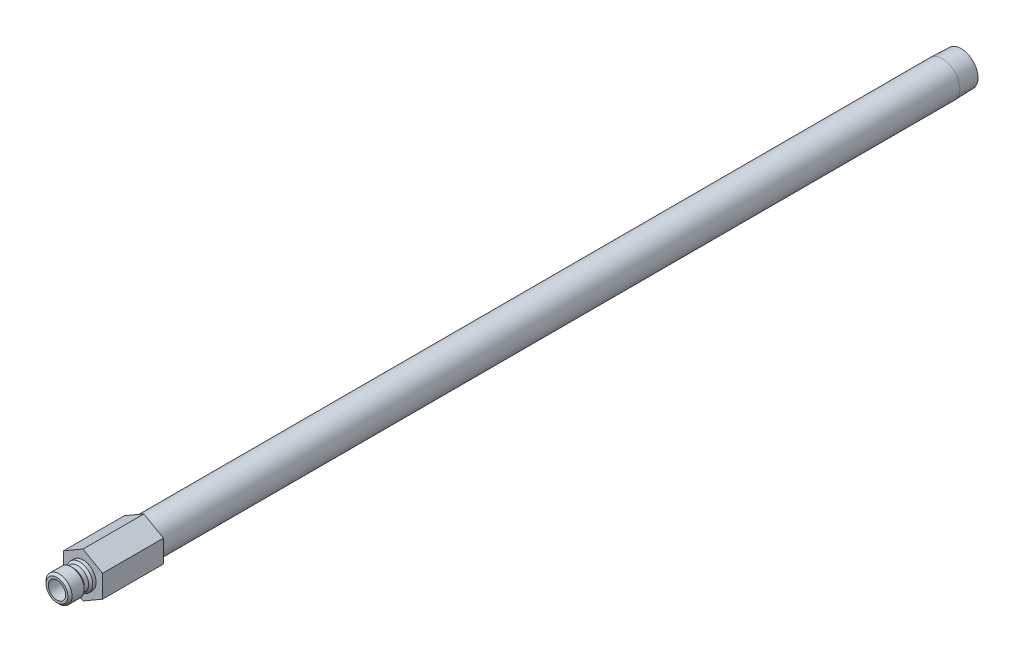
ISO-10303-21;
HEADER;
FILE_DESCRIPTION(('STEP AP214'),'2;1');
FILE_NAME('part.step','',(''),(''),'','','');
FILE_SCHEMA(('AUTOMOTIVE_DESIGN { 1 0 10303 214 1 1 1 1 }'));
ENDSEC;
DATA;
#1=APPLICATION_CONTEXT('core data for automotive mechanical design processes');
#2=APPLICATION_PROTOCOL_DEFINITION('international standard','automotive_design',2000,#1);
#3=PRODUCT_CONTEXT('',#1,'mechanical');
#4=PRODUCT('Part','Part','',(#3));
#5=PRODUCT_RELATED_PRODUCT_CATEGORY('part','',(#4));
#6=PRODUCT_DEFINITION_FORMATION('','',#4);
#7=PRODUCT_DEFINITION_CONTEXT('part definition',#1,'design');
#8=PRODUCT_DEFINITION('design','',#6,#7);
#9=PRODUCT_DEFINITION_SHAPE('','',#8);
#10=(LENGTH_UNIT() NAMED_UNIT(*) SI_UNIT(.MILLI.,.METRE.));
#11=(NAMED_UNIT(*) PLANE_ANGLE_UNIT() SI_UNIT($,.RADIAN.));
#12=(NAMED_UNIT(*) SI_UNIT($,.STERADIAN.) SOLID_ANGLE_UNIT());
#13=UNCERTAINTY_MEASURE_WITH_UNIT(LENGTH_MEASURE(1.E-05),#10,'distance_accuracy_value','');
#14=(GEOMETRIC_REPRESENTATION_CONTEXT(3) GLOBAL_UNCERTAINTY_ASSIGNED_CONTEXT((#13)) GLOBAL_UNIT_ASSIGNED_CONTEXT((#10,
#11,#12)) REPRESENTATION_CONTEXT('',''));
#15=CARTESIAN_POINT('',(0.,0.,0.));
#16=DIRECTION('',(0.,0.,1.));
#17=DIRECTION('',(1.,0.,0.));
#18=AXIS2_PLACEMENT_3D('',#15,#16,#17);
#19=CARTESIAN_POINT('',(0.,0.,0.));
#20=DIRECTION('',(0.,0.,-1.));
#21=DIRECTION('',(0.,1.,0.));
#22=AXIS2_PLACEMENT_3D('',#19,#20,#21);
#23=CYLINDRICAL_SURFACE('',#22,6.34999999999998);
#24=CARTESIAN_POINT('',(0.,0.,-313.817));
#25=DIRECTION('',(0.,0.,-1.));
#26=DIRECTION('',(0.,1.,0.));
#27=AXIS2_PLACEMENT_3D('',#24,#25,#26);
#28=CIRCLE('',#27,6.34999999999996);
#29=CARTESIAN_POINT('',(0.,6.35,-313.817));
#30=VERTEX_POINT('',#29);
#31=EDGE_CURVE('E42',#30,#30,#28,.T.);
#32=ORIENTED_EDGE('',*,*,#31,.F.);
#33=EDGE_LOOP('',(#32));
#34=FACE_BOUND('',#33,.T.);
#35=CARTESIAN_POINT('',(0.,0.,-22.225));
#36=DIRECTION('',(0.,0.,1.));
#37=DIRECTION('',(1.,0.,0.));
#38=AXIS2_PLACEMENT_3D('',#35,#36,#37);
#39=CIRCLE('',#38,6.34999999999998);
#40=CARTESIAN_POINT('',(6.34999999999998,0.,-22.225));
#41=VERTEX_POINT('',#40);
#42=EDGE_CURVE('E138',#41,#41,#39,.F.);
#43=ORIENTED_EDGE('',*,*,#42,.T.);
#44=EDGE_LOOP('',(#43));
#45=FACE_BOUND('',#44,.T.);
#46=ADVANCED_FACE('F33',(#34,#45),#23,.T.);
#47=CARTESIAN_POINT('',(0.,6.1356887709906,-320.675));
#48=DIRECTION('',(0.,0.,-1.));
#49=DIRECTION('',(0.,1.,0.));
#50=AXIS2_PLACEMENT_3D('',#47,#48,#49);
#51=PLANE('',#50);
#52=CARTESIAN_POINT('',(0.,0.,-320.675));
#53=DIRECTION('',(0.,0.,-1.));
#54=DIRECTION('',(0.,1.,0.));
#55=AXIS2_PLACEMENT_3D('',#52,#53,#54);
#56=CIRCLE('',#55,6.13568877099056);
#57=CARTESIAN_POINT('',(0.,6.1356887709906,-320.675));
#58=VERTEX_POINT('',#57);
#59=EDGE_CURVE('E11',#58,#58,#56,.T.);
#60=ORIENTED_EDGE('',*,*,#59,.T.);
#61=EDGE_LOOP('',(#60));
#62=FACE_BOUND('',#61,.T.);
#63=CARTESIAN_POINT('',(0.,0.,-320.675));
#64=DIRECTION('',(0.,0.,-1.));
#65=DIRECTION('',(0.,1.,0.));
#66=AXIS2_PLACEMENT_3D('',#63,#64,#65);
#67=CIRCLE('',#66,4.62279999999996);
#68=CARTESIAN_POINT('',(0.,4.6228,-320.675));
#69=VERTEX_POINT('',#68);
#70=EDGE_CURVE('E146',#69,#69,#67,.T.);
#71=ORIENTED_EDGE('',*,*,#70,.F.);
#72=EDGE_LOOP('',(#71));
#73=FACE_BOUND('',#72,.T.);
#74=ADVANCED_FACE('F35',(#62,#73),#51,.T.);
#75=CARTESIAN_POINT('',(0.,0.,-320.675));
#76=DIRECTION('',(0.,0.,1.));
#77=DIRECTION('',(0.,-1.,0.));
#78=AXIS2_PLACEMENT_3D('',#75,#76,#77);
#79=CONICAL_SURFACE('',#78,6.13568877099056,0.0312396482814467);
#80=ORIENTED_EDGE('',*,*,#31,.T.);
#81=EDGE_LOOP('',(#80));
#82=FACE_BOUND('',#81,.T.);
#83=ORIENTED_EDGE('',*,*,#59,.F.);
#84=EDGE_LOOP('',(#83));
#85=FACE_BOUND('',#84,.T.);
#86=ADVANCED_FACE('F181',(#82,#85),#79,.T.);
#87=CARTESIAN_POINT('',(0.,4.7625,0.));
#88=DIRECTION('',(0.,0.,1.));
#89=DIRECTION('',(0.,-1.,0.));
#90=AXIS2_PLACEMENT_3D('',#87,#88,#89);
#91=PLANE('',#90);
#92=CARTESIAN_POINT('',(0.,0.,0.));
#93=DIRECTION('',(0.,0.,-1.));
#94=DIRECTION('',(0.,1.,0.));
#95=AXIS2_PLACEMENT_3D('',#92,#93,#94);
#96=CIRCLE('',#95,4.7625);
#97=CARTESIAN_POINT('',(0.,4.7625,0.));
#98=VERTEX_POINT('',#97);
#99=EDGE_CURVE('E176',#98,#98,#96,.T.);
#100=ORIENTED_EDGE('',*,*,#99,.T.);
#101=EDGE_LOOP('',(#100));
#102=FACE_BOUND('',#101,.T.);
#103=DIRECTION('',(-0.866025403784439,-0.5,0.));
#104=VECTOR('',#103,1.);
#105=CARTESIAN_POINT('',(0.,8.21223022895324,0.));
#106=LINE('',#105,#104);
#107=CARTESIAN_POINT('',(0.,8.21223022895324,0.));
#108=VERTEX_POINT('',#107);
#109=CARTESIAN_POINT('',(-7.112,4.10611511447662,0.));
#110=VERTEX_POINT('',#109);
#111=EDGE_CURVE('E121',#108,#110,#106,.T.);
#112=ORIENTED_EDGE('',*,*,#111,.T.);
#113=DIRECTION('',(0.,-1.,0.));
#114=VECTOR('',#113,1.);
#115=CARTESIAN_POINT('',(-7.112,4.10611511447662,0.));
#116=LINE('',#115,#114);
#117=CARTESIAN_POINT('',(-7.112,-4.10611511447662,0.));
#118=VERTEX_POINT('',#117);
#119=EDGE_CURVE('E124',#110,#118,#116,.T.);
#120=ORIENTED_EDGE('',*,*,#119,.T.);
#121=DIRECTION('',(0.866025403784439,-0.5,0.));
#122=VECTOR('',#121,1.);
#123=CARTESIAN_POINT('',(-7.112,-4.10611511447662,0.));
#124=LINE('',#123,#122);
#125=CARTESIAN_POINT('',(0.,-8.21223022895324,0.));
#126=VERTEX_POINT('',#125);
#127=EDGE_CURVE('E127',#118,#126,#124,.T.);
#128=ORIENTED_EDGE('',*,*,#127,.T.);
#129=DIRECTION('',(0.866025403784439,0.5,0.));
#130=VECTOR('',#129,1.);
#131=CARTESIAN_POINT('',(0.,-8.21223022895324,0.));
#132=LINE('',#131,#130);
#133=CARTESIAN_POINT('',(7.112,-4.10611511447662,0.));
#134=VERTEX_POINT('',#133);
#135=EDGE_CURVE('E130',#126,#134,#132,.T.);
#136=ORIENTED_EDGE('',*,*,#135,.T.);
#137=DIRECTION('',(0.,1.,0.));
#138=VECTOR('',#137,1.);
#139=CARTESIAN_POINT('',(7.112,-4.10611511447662,0.));
#140=LINE('',#139,#138);
#141=CARTESIAN_POINT('',(7.112,4.10611511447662,0.));
#142=VERTEX_POINT('',#141);
#143=EDGE_CURVE('E98',#134,#142,#140,.T.);
#144=ORIENTED_EDGE('',*,*,#143,.T.);
#145=DIRECTION('',(-0.866025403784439,0.5,0.));
#146=VECTOR('',#145,1.);
#147=CARTESIAN_POINT('',(7.112,4.10611511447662,0.));
#148=LINE('',#147,#146);
#149=EDGE_CURVE('E133',#142,#108,#148,.T.);
#150=ORIENTED_EDGE('',*,*,#149,.T.);
#151=EDGE_LOOP('',(#112,#120,#128,#136,#144,#150));
#152=FACE_BOUND('',#151,.T.);
#153=ADVANCED_FACE('F250',(#102,#152),#91,.T.);
#154=CARTESIAN_POINT('',(0.,0.,0.));
#155=DIRECTION('',(0.,0.,-1.));
#156=DIRECTION('',(0.,1.,0.));
#157=AXIS2_PLACEMENT_3D('',#154,#155,#156);
#158=CYLINDRICAL_SURFACE('',#157,4.7625);
#159=CARTESIAN_POINT('',(0.,0.,1.2065));
#160=DIRECTION('',(0.,0.,-1.));
#161=DIRECTION('',(0.,1.,0.));
#162=AXIS2_PLACEMENT_3D('',#159,#160,#161);
#163=CIRCLE('',#162,4.7625);
#164=CARTESIAN_POINT('',(0.,4.7625,1.2065));
#165=VERTEX_POINT('',#164);
#166=EDGE_CURVE('E173',#165,#165,#163,.T.);
#167=ORIENTED_EDGE('',*,*,#166,.T.);
#168=EDGE_LOOP('',(#167));
#169=FACE_BOUND('',#168,.T.);
#170=ORIENTED_EDGE('',*,*,#99,.F.);
#171=EDGE_LOOP('',(#170));
#172=FACE_BOUND('',#171,.T.);
#173=ADVANCED_FACE('F246',(#169,#172),#158,.T.);
#174=CARTESIAN_POINT('',(0.,0.,1.2065));
#175=DIRECTION('',(0.,0.,-1.));
#176=DIRECTION('',(0.,1.,0.));
#177=AXIS2_PLACEMENT_3D('',#174,#175,#176);
#178=CONICAL_SURFACE('',#177,4.7625,0.785398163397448);
#179=CARTESIAN_POINT('',(0.,0.,1.9685));
#180=DIRECTION('',(0.,0.,-1.));
#181=DIRECTION('',(0.,1.,0.));
#182=AXIS2_PLACEMENT_3D('',#179,#180,#181);
#183=CIRCLE('',#182,4.0005);
#184=CARTESIAN_POINT('',(0.,4.0005,1.9685));
#185=VERTEX_POINT('',#184);
#186=EDGE_CURVE('E170',#185,#185,#183,.T.);
#187=ORIENTED_EDGE('',*,*,#186,.T.);
#188=EDGE_LOOP('',(#187));
#189=FACE_BOUND('',#188,.T.);
#190=ORIENTED_EDGE('',*,*,#166,.F.);
#191=EDGE_LOOP('',(#190));
#192=FACE_BOUND('',#191,.T.);
#193=ADVANCED_FACE('F242',(#189,#192),#178,.T.);
#194=CARTESIAN_POINT('',(0.,0.,0.));
#195=DIRECTION('',(0.,0.,-1.));
#196=DIRECTION('',(0.,1.,0.));
#197=AXIS2_PLACEMENT_3D('',#194,#195,#196);
#198=CYLINDRICAL_SURFACE('',#197,4.0005);
#199=CARTESIAN_POINT('',(0.,0.,3.556));
#200=DIRECTION('',(0.,0.,-1.));
#201=DIRECTION('',(0.,1.,0.));
#202=AXIS2_PLACEMENT_3D('',#199,#200,#201);
#203=CIRCLE('',#202,4.0005);
#204=CARTESIAN_POINT('',(0.,4.0005,3.556));
#205=VERTEX_POINT('',#204);
#206=EDGE_CURVE('E167',#205,#205,#203,.T.);
#207=ORIENTED_EDGE('',*,*,#206,.T.);
#208=EDGE_LOOP('',(#207));
#209=FACE_BOUND('',#208,.T.);
#210=ORIENTED_EDGE('',*,*,#186,.F.);
#211=EDGE_LOOP('',(#210));
#212=FACE_BOUND('',#211,.T.);
#213=ADVANCED_FACE('F238',(#209,#212),#198,.T.);
#214=CARTESIAN_POINT('',(0.,0.,3.556));
#215=DIRECTION('',(0.,0.,1.));
#216=DIRECTION('',(0.,-1.,0.));
#217=AXIS2_PLACEMENT_3D('',#214,#215,#216);
#218=CONICAL_SURFACE('',#217,4.0005,0.785398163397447);
#219=CARTESIAN_POINT('',(0.,0.,4.318));
#220=DIRECTION('',(0.,0.,-1.));
#221=DIRECTION('',(0.,1.,0.));
#222=AXIS2_PLACEMENT_3D('',#219,#220,#221);
#223=CIRCLE('',#222,4.7625);
#224=CARTESIAN_POINT('',(0.,4.7625,4.318));
#225=VERTEX_POINT('',#224);
#226=EDGE_CURVE('E164',#225,#225,#223,.T.);
#227=ORIENTED_EDGE('',*,*,#226,.T.);
#228=EDGE_LOOP('',(#227));
#229=FACE_BOUND('',#228,.T.);
#230=ORIENTED_EDGE('',*,*,#206,.F.);
#231=EDGE_LOOP('',(#230));
#232=FACE_BOUND('',#231,.T.);
#233=ADVANCED_FACE('F234',(#229,#232),#218,.T.);
#234=CARTESIAN_POINT('',(0.,0.,0.));
#235=DIRECTION('',(0.,0.,-1.));
#236=DIRECTION('',(0.,1.,0.));
#237=AXIS2_PLACEMENT_3D('',#234,#235,#236);
#238=CYLINDRICAL_SURFACE('',#237,4.7625);
#239=CARTESIAN_POINT('',(0.,0.,8.763));
#240=DIRECTION('',(0.,0.,-1.));
#241=DIRECTION('',(0.,1.,0.));
#242=AXIS2_PLACEMENT_3D('',#239,#240,#241);
#243=CIRCLE('',#242,4.7625);
#244=CARTESIAN_POINT('',(0.,4.7625,8.763));
#245=VERTEX_POINT('',#244);
#246=EDGE_CURVE('E161',#245,#245,#243,.T.);
#247=ORIENTED_EDGE('',*,*,#246,.T.);
#248=EDGE_LOOP('',(#247));
#249=FACE_BOUND('',#248,.T.);
#250=ORIENTED_EDGE('',*,*,#226,.F.);
#251=EDGE_LOOP('',(#250));
#252=FACE_BOUND('',#251,.T.);
#253=ADVANCED_FACE('F230',(#249,#252),#238,.T.);
#254=CARTESIAN_POINT('',(0.,0.,8.763));
#255=DIRECTION('',(0.,0.,-1.));
#256=DIRECTION('',(0.,1.,0.));
#257=AXIS2_PLACEMENT_3D('',#254,#255,#256);
#258=CONICAL_SURFACE('',#257,4.7625,0.785398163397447);
#259=CARTESIAN_POINT('',(0.,0.,9.525));
#260=DIRECTION('',(0.,0.,-1.));
#261=DIRECTION('',(0.,1.,0.));
#262=AXIS2_PLACEMENT_3D('',#259,#260,#261);
#263=CIRCLE('',#262,4.0005);
#264=CARTESIAN_POINT('',(0.,4.0005,9.525));
#265=VERTEX_POINT('',#264);
#266=EDGE_CURVE('E158',#265,#265,#263,.T.);
#267=ORIENTED_EDGE('',*,*,#266,.T.);
#268=EDGE_LOOP('',(#267));
#269=FACE_BOUND('',#268,.T.);
#270=ORIENTED_EDGE('',*,*,#246,.F.);
#271=EDGE_LOOP('',(#270));
#272=FACE_BOUND('',#271,.T.);
#273=ADVANCED_FACE('F226',(#269,#272),#258,.T.);
#274=CARTESIAN_POINT('',(0.,3.175,9.525));
#275=DIRECTION('',(0.,0.,1.));
#276=DIRECTION('',(0.,-1.,0.));
#277=AXIS2_PLACEMENT_3D('',#274,#275,#276);
#278=PLANE('',#277);
#279=CARTESIAN_POINT('',(0.,0.,9.525));
#280=DIRECTION('',(0.,0.,-1.));
#281=DIRECTION('',(0.,1.,0.));
#282=AXIS2_PLACEMENT_3D('',#279,#280,#281);
#283=CIRCLE('',#282,3.175);
#284=CARTESIAN_POINT('',(0.,3.175,9.525));
#285=VERTEX_POINT('',#284);
#286=EDGE_CURVE('E155',#285,#285,#283,.T.);
#287=ORIENTED_EDGE('',*,*,#286,.T.);
#288=EDGE_LOOP('',(#287));
#289=FACE_BOUND('',#288,.T.);
#290=ORIENTED_EDGE('',*,*,#266,.F.);
#291=EDGE_LOOP('',(#290));
#292=FACE_BOUND('',#291,.T.);
#293=ADVANCED_FACE('F222',(#289,#292),#278,.T.);
#294=CARTESIAN_POINT('',(0.,0.,0.));
#295=DIRECTION('',(0.,0.,-1.));
#296=DIRECTION('',(0.,1.,0.));
#297=AXIS2_PLACEMENT_3D('',#294,#295,#296);
#298=CYLINDRICAL_SURFACE('',#297,3.175);
#299=ORIENTED_EDGE('',*,*,#286,.F.);
#300=EDGE_LOOP('',(#299));
#301=FACE_BOUND('',#300,.T.);
#302=CARTESIAN_POINT('',(0.,0.,-22.225));
#303=DIRECTION('',(0.,0.,-1.));
#304=DIRECTION('',(0.,1.,0.));
#305=AXIS2_PLACEMENT_3D('',#302,#303,#304);
#306=CIRCLE('',#305,3.175);
#307=CARTESIAN_POINT('',(0.,3.175,-22.225));
#308=VERTEX_POINT('',#307);
#309=EDGE_CURVE('E152',#308,#308,#306,.T.);
#310=ORIENTED_EDGE('',*,*,#309,.T.);
#311=EDGE_LOOP('',(#310));
#312=FACE_BOUND('',#311,.T.);
#313=ADVANCED_FACE('F218',(#301,#312),#298,.F.);
#314=CARTESIAN_POINT('',(0.,4.6228,-22.225));
#315=DIRECTION('',(0.,0.,-1.));
#316=DIRECTION('',(0.,1.,0.));
#317=AXIS2_PLACEMENT_3D('',#314,#315,#316);
#318=PLANE('',#317);
#319=CARTESIAN_POINT('',(0.,0.,-22.225));
#320=DIRECTION('',(0.,0.,-1.));
#321=DIRECTION('',(0.,1.,0.));
#322=AXIS2_PLACEMENT_3D('',#319,#320,#321);
#323=CIRCLE('',#322,4.6228);
#324=CARTESIAN_POINT('',(0.,4.6228,-22.225));
#325=VERTEX_POINT('',#324);
#326=EDGE_CURVE('E149',#325,#325,#323,.T.);
#327=ORIENTED_EDGE('',*,*,#326,.T.);
#328=EDGE_LOOP('',(#327));
#329=FACE_BOUND('',#328,.T.);
#330=ORIENTED_EDGE('',*,*,#309,.F.);
#331=EDGE_LOOP('',(#330));
#332=FACE_BOUND('',#331,.T.);
#333=ADVANCED_FACE('F199',(#329,#332),#318,.T.);
#334=CARTESIAN_POINT('',(0.,0.,0.));
#335=DIRECTION('',(0.,0.,-1.));
#336=DIRECTION('',(0.,1.,0.));
#337=AXIS2_PLACEMENT_3D('',#334,#335,#336);
#338=CYLINDRICAL_SURFACE('',#337,4.62279999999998);
#339=ORIENTED_EDGE('',*,*,#70,.T.);
#340=EDGE_LOOP('',(#339));
#341=FACE_BOUND('',#340,.T.);
#342=ORIENTED_EDGE('',*,*,#326,.F.);
#343=EDGE_LOOP('',(#342));
#344=FACE_BOUND('',#343,.T.);
#345=ADVANCED_FACE('F191',(#341,#344),#338,.F.);
#346=CARTESIAN_POINT('',(-7.112,4.10611511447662,-22.225));
#347=DIRECTION('',(0.,0.,1.));
#348=DIRECTION('',(1.,0.,0.));
#349=AXIS2_PLACEMENT_3D('',#346,#347,#348);
#350=PLANE('',#349);
#351=ORIENTED_EDGE('',*,*,#42,.F.);
#352=EDGE_LOOP('',(#351));
#353=FACE_BOUND('',#352,.T.);
#354=DIRECTION('',(-0.866025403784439,-0.5,0.));
#355=VECTOR('',#354,1.);
#356=CARTESIAN_POINT('',(0.,8.21223022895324,-22.225));
#357=LINE('',#356,#355);
#358=CARTESIAN_POINT('',(0.,8.21223022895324,-22.225));
#359=VERTEX_POINT('',#358);
#360=CARTESIAN_POINT('',(-7.112,4.10611511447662,-22.225));
#361=VERTEX_POINT('',#360);
#362=EDGE_CURVE('E136',#359,#361,#357,.T.);
#363=ORIENTED_EDGE('',*,*,#362,.F.);
#364=DIRECTION('',(-0.866025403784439,0.5,0.));
#365=VECTOR('',#364,1.);
#366=CARTESIAN_POINT('',(7.112,4.10611511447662,-22.225));
#367=LINE('',#366,#365);
#368=CARTESIAN_POINT('',(7.112,4.10611511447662,-22.225));
#369=VERTEX_POINT('',#368);
#370=EDGE_CURVE('E111',#369,#359,#367,.T.);
#371=ORIENTED_EDGE('',*,*,#370,.F.);
#372=DIRECTION('',(0.,1.,0.));
#373=VECTOR('',#372,1.);
#374=CARTESIAN_POINT('',(7.112,-4.10611511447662,-22.225));
#375=LINE('',#374,#373);
#376=CARTESIAN_POINT('',(7.112,-4.10611511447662,-22.225));
#377=VERTEX_POINT('',#376);
#378=EDGE_CURVE('E96',#377,#369,#375,.T.);
#379=ORIENTED_EDGE('',*,*,#378,.F.);
#380=DIRECTION('',(0.866025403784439,0.5,0.));
#381=VECTOR('',#380,1.);
#382=CARTESIAN_POINT('',(0.,-8.21223022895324,-22.225));
#383=LINE('',#382,#381);
#384=CARTESIAN_POINT('',(0.,-8.21223022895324,-22.225));
#385=VERTEX_POINT('',#384);
#386=EDGE_CURVE('E109',#385,#377,#383,.T.);
#387=ORIENTED_EDGE('',*,*,#386,.F.);
#388=DIRECTION('',(0.866025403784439,-0.5,0.));
#389=VECTOR('',#388,1.);
#390=CARTESIAN_POINT('',(-7.112,-4.10611511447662,-22.225));
#391=LINE('',#390,#389);
#392=CARTESIAN_POINT('',(-7.112,-4.10611511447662,-22.225));
#393=VERTEX_POINT('',#392);
#394=EDGE_CURVE('E114',#393,#385,#391,.T.);
#395=ORIENTED_EDGE('',*,*,#394,.F.);
#396=DIRECTION('',(0.,-1.,0.));
#397=VECTOR('',#396,1.);
#398=CARTESIAN_POINT('',(-7.112,4.10611511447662,-22.225));
#399=LINE('',#398,#397);
#400=EDGE_CURVE('E116',#361,#393,#399,.T.);
#401=ORIENTED_EDGE('',*,*,#400,.F.);
#402=EDGE_LOOP('',(#363,#371,#379,#387,#395,#401));
#403=FACE_BOUND('',#402,.T.);
#404=ADVANCED_FACE('F107',(#353,#403),#350,.F.);
#405=CARTESIAN_POINT('',(0.,8.21223022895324,-22.225));
#406=DIRECTION('',(-0.5,0.866025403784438,0.));
#407=DIRECTION('',(-0.866025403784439,-0.5,0.));
#408=AXIS2_PLACEMENT_3D('',#405,#406,#407);
#409=PLANE('',#408);
#410=ORIENTED_EDGE('',*,*,#111,.F.);
#411=DIRECTION('',(0.,0.,1.));
#412=VECTOR('',#411,1.);
#413=CARTESIAN_POINT('',(0.,8.21223022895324,-22.225));
#414=LINE('',#413,#412);
#415=EDGE_CURVE('E50',#359,#108,#414,.T.);
#416=ORIENTED_EDGE('',*,*,#415,.F.);
#417=ORIENTED_EDGE('',*,*,#362,.T.);
#418=DIRECTION('',(0.,0.,1.));
#419=VECTOR('',#418,1.);
#420=CARTESIAN_POINT('',(-7.112,4.10611511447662,-22.225));
#421=LINE('',#420,#419);
#422=EDGE_CURVE('E85',#361,#110,#421,.T.);
#423=ORIENTED_EDGE('',*,*,#422,.T.);
#424=EDGE_LOOP('',(#410,#416,#417,#423));
#425=FACE_BOUND('',#424,.T.);
#426=ADVANCED_FACE('F190',(#425),#409,.T.);
#427=CARTESIAN_POINT('',(7.112,4.10611511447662,-22.225));
#428=DIRECTION('',(0.5,0.866025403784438,0.));
#429=DIRECTION('',(-0.866025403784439,0.5,0.));
#430=AXIS2_PLACEMENT_3D('',#427,#428,#429);
#431=PLANE('',#430);
#432=ORIENTED_EDGE('',*,*,#149,.F.);
#433=DIRECTION('',(0.,0.,1.));
#434=VECTOR('',#433,1.);
#435=CARTESIAN_POINT('',(7.112,4.10611511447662,-22.225));
#436=LINE('',#435,#434);
#437=EDGE_CURVE('E73',#369,#142,#436,.T.);
#438=ORIENTED_EDGE('',*,*,#437,.F.);
#439=ORIENTED_EDGE('',*,*,#370,.T.);
#440=ORIENTED_EDGE('',*,*,#415,.T.);
#441=EDGE_LOOP('',(#432,#438,#439,#440));
#442=FACE_BOUND('',#441,.T.);
#443=ADVANCED_FACE('F197',(#442),#431,.T.);
#444=CARTESIAN_POINT('',(7.112,-4.10611511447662,-22.225));
#445=DIRECTION('',(1.,0.,0.));
#446=DIRECTION('',(0.,1.,0.));
#447=AXIS2_PLACEMENT_3D('',#444,#445,#446);
#448=PLANE('',#447);
#449=ORIENTED_EDGE('',*,*,#143,.F.);
#450=DIRECTION('',(0.,0.,1.));
#451=VECTOR('',#450,1.);
#452=CARTESIAN_POINT('',(7.112,-4.10611511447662,-22.225));
#453=LINE('',#452,#451);
#454=EDGE_CURVE('E93',#377,#134,#453,.T.);
#455=ORIENTED_EDGE('',*,*,#454,.F.);
#456=ORIENTED_EDGE('',*,*,#378,.T.);
#457=ORIENTED_EDGE('',*,*,#437,.T.);
#458=EDGE_LOOP('',(#449,#455,#456,#457));
#459=FACE_BOUND('',#458,.T.);
#460=ADVANCED_FACE('F95',(#459),#448,.T.);
#461=CARTESIAN_POINT('',(0.,-8.21223022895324,-22.225));
#462=DIRECTION('',(0.5,-0.866025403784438,0.));
#463=DIRECTION('',(0.866025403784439,0.5,0.));
#464=AXIS2_PLACEMENT_3D('',#461,#462,#463);
#465=PLANE('',#464);
#466=ORIENTED_EDGE('',*,*,#135,.F.);
#467=DIRECTION('',(0.,0.,1.));
#468=VECTOR('',#467,1.);
#469=CARTESIAN_POINT('',(0.,-8.21223022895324,-22.225));
#470=LINE('',#469,#468);
#471=EDGE_CURVE('E103',#385,#126,#470,.T.);
#472=ORIENTED_EDGE('',*,*,#471,.F.);
#473=ORIENTED_EDGE('',*,*,#386,.T.);
#474=ORIENTED_EDGE('',*,*,#454,.T.);
#475=EDGE_LOOP('',(#466,#472,#473,#474));
#476=FACE_BOUND('',#475,.T.);
#477=ADVANCED_FACE('F113',(#476),#465,.T.);
#478=CARTESIAN_POINT('',(-7.112,-4.10611511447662,-22.225));
#479=DIRECTION('',(-0.5,-0.866025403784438,0.));
#480=DIRECTION('',(0.866025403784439,-0.5,0.));
#481=AXIS2_PLACEMENT_3D('',#478,#479,#480);
#482=PLANE('',#481);
#483=ORIENTED_EDGE('',*,*,#127,.F.);
#484=DIRECTION('',(0.,0.,1.));
#485=VECTOR('',#484,1.);
#486=CARTESIAN_POINT('',(-7.112,-4.10611511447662,-22.225));
#487=LINE('',#486,#485);
#488=EDGE_CURVE('E141',#393,#118,#487,.T.);
#489=ORIENTED_EDGE('',*,*,#488,.F.);
#490=ORIENTED_EDGE('',*,*,#394,.T.);
#491=ORIENTED_EDGE('',*,*,#471,.T.);
#492=EDGE_LOOP('',(#483,#489,#490,#491));
#493=FACE_BOUND('',#492,.T.);
#494=ADVANCED_FACE('F209',(#493),#482,.T.);
#495=CARTESIAN_POINT('',(-7.112,4.10611511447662,-22.225));
#496=DIRECTION('',(-1.,0.,0.));
#497=DIRECTION('',(0.,0.,1.));
#498=AXIS2_PLACEMENT_3D('',#495,#496,#497);
#499=PLANE('',#498);
#500=ORIENTED_EDGE('',*,*,#119,.F.);
#501=ORIENTED_EDGE('',*,*,#422,.F.);
#502=ORIENTED_EDGE('',*,*,#400,.T.);
#503=ORIENTED_EDGE('',*,*,#488,.T.);
#504=EDGE_LOOP('',(#500,#501,#502,#503));
#505=FACE_BOUND('',#504,.T.);
#506=ADVANCED_FACE('F212',(#505),#499,.T.);
#507=CLOSED_SHELL('',(#46,#74,#86,#153,#173,#193,#213,#233,#253,#273,#293,#313,#333,#345,#404,
#426,#443,#460,#477,#494,#506));
#508=MANIFOLD_SOLID_BREP('B2',#507);
#509=ADVANCED_BREP_SHAPE_REPRESENTATION('',(#18,#508),#14);
#510=SHAPE_DEFINITION_REPRESENTATION(#9,#509);
ENDSEC;
END-ISO-10303-21;
